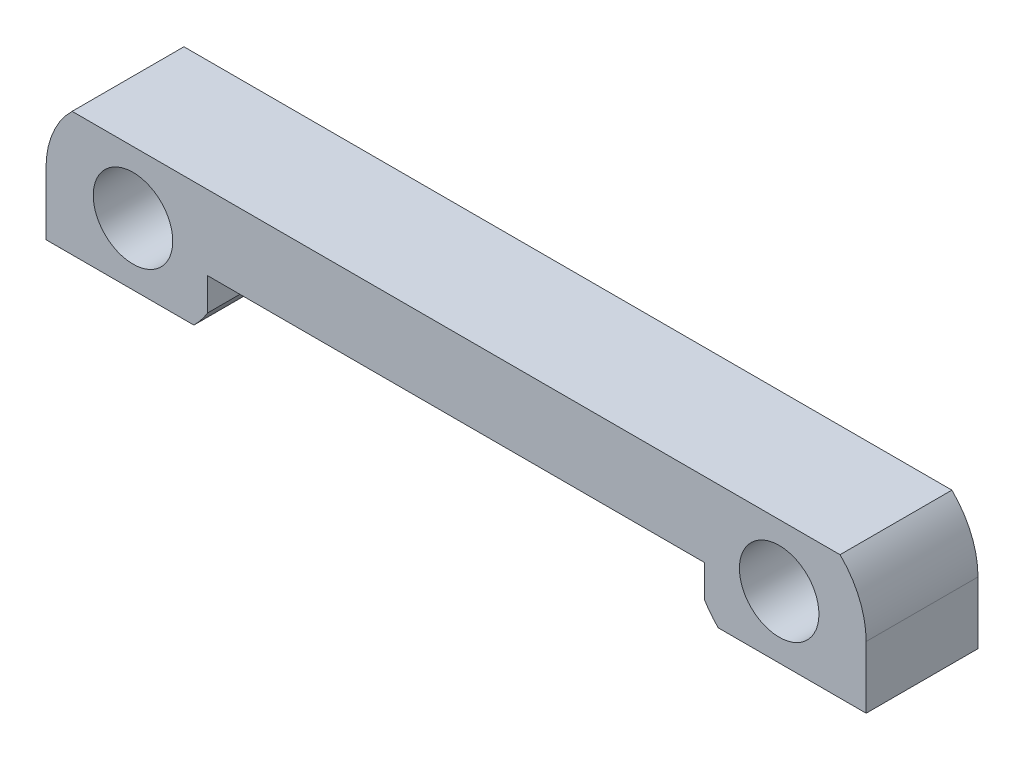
from build123d import *

# Parameters (mm, degrees)
SKETCH_1_W          = 33
SKETCH_1_H          = 4.5
EXTRUDE_1_DEPTH     = 5
CUT_EXTRUDE_1_DEPTH = 5


with BuildPart() as part:
    # Sketch 1 → Extrude 1 (new body)
    with BuildSketch(Plane(origin=(0, 0, 0), x_dir=(1, 0, 0), z_dir=(0, 1, 0))):
        with Locations((-2.654946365, 6.088498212)):
            Rectangle(SKETCH_1_W, SKETCH_1_H)
    extrude(amount=EXTRUDE_1_DEPTH)

    # Sketch 2 → Cut-Extrude 1 (cut)
    with BuildSketch(Plane.XY.offset(-3.838498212)):
        with BuildLine():
            ThreePointArc((-12.654946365, 0.697224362), (-12.357908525, 1.32546116), (-12.19084475, 2))
            Line((-12.19084475, 2), (-12.654946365, 2))
            Line((-12.654946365, 2), (-12.654946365, 0.697224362))
        make_face()
        with BuildLine():
            Line((-12.654946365, 0), (7.345053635, 0))
            Line((7.345053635, 0), (7.345053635, 0.697224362))
            ThreePointArc((7.345053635, 0.697224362), (7.048015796, 1.32546116), (6.88095202, 2))
            Line((6.88095202, 2), (-12.19084475, 2))
            ThreePointArc((-12.19084475, 2), (-12.357908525, 1.32546116), (-12.654946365, 0.697224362))
            Line((-12.654946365, 0.697224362), (-12.654946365, 0))
        make_face()
        with BuildLine():
            Line((-13.205456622, 0), (-12.654946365, 0))
            Line((-12.654946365, 0), (-12.654946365, 0.697224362))
            ThreePointArc((-12.654946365, 0.697224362), (-12.907990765, 0.331075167), (-13.205456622, 0))
        make_face()
        with BuildLine():
            Line((7.345053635, 0.697224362), (7.345053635, 2))
            Line((7.345053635, 2), (6.88095202, 2))
            ThreePointArc((6.88095202, 2), (7.048015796, 1.32546116), (7.345053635, 0.697224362))
        make_face()
        with BuildLine():
            Line((7.345053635, 0), (7.895563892, 0))
            ThreePointArc((7.895563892, 0), (7.598098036, 0.331075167), (7.345053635, 0.697224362))
            Line((7.345053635, 0.697224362), (7.345053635, 0))
        make_face()
        with BuildLine():
            ThreePointArc((-17.254946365, 2.5), (-15.654946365, 0.9), (-14.054946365, 2.5))
            Line((-14.054946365, 2.5), (-17.254946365, 2.5))
        make_face()
        with BuildLine():
            Line((-17.254946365, 2.5), (-14.054946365, 2.5))
            ThreePointArc((-14.054946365, 2.5), (-15.654946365, 4.1), (-17.254946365, 2.5))
        make_face()
        with BuildLine():
            ThreePointArc((-17.254946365, 2.5), (-15.654946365, 0.9), (-14.054946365, 2.5))
            Line((-14.054946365, 2.5), (-17.254946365, 2.5))
        make_face()
        with BuildLine():
            Line((-17.254946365, 2.5), (-14.054946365, 2.5))
            ThreePointArc((-14.054946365, 2.5), (-15.654946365, 4.1), (-17.254946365, 2.5))
        make_face()
        with BuildLine():
            ThreePointArc((8.745053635, 2.5), (10.345053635, 0.9), (11.945053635, 2.5))
            Line((11.945053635, 2.5), (8.745053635, 2.5))
        make_face()
        with BuildLine():
            Line((8.745053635, 2.5), (11.945053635, 2.5))
            ThreePointArc((11.945053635, 2.5), (10.345053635, 4.1), (8.745053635, 2.5))
        make_face()
        with BuildLine():
            ThreePointArc((8.745053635, 2.5), (10.345053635, 0.9), (11.945053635, 2.5))
            Line((11.945053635, 2.5), (8.745053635, 2.5))
        make_face()
        with BuildLine():
            Line((8.745053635, 2.5), (11.945053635, 2.5))
            ThreePointArc((11.945053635, 2.5), (10.345053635, 4.1), (8.745053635, 2.5))
        make_face()
        with BuildLine():
            ThreePointArc((-19.154946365, 2.5), (-18.881648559, 3.855873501), (-18.104436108, 5))
            Line((-18.104436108, 5), (-19.154946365, 5))
            Line((-19.154946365, 5), (-19.154946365, 2.5))
        make_face()
        with BuildLine():
            ThreePointArc((12.794543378, 5), (13.571755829, 3.855873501), (13.845053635, 2.5))
            Line((13.845053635, 2.5), (13.845053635, 5))
            Line((13.845053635, 5), (12.794543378, 5))
        make_face()
    extrude(amount=-CUT_EXTRUDE_1_DEPTH, mode=Mode.SUBTRACT)


solid = part.part
